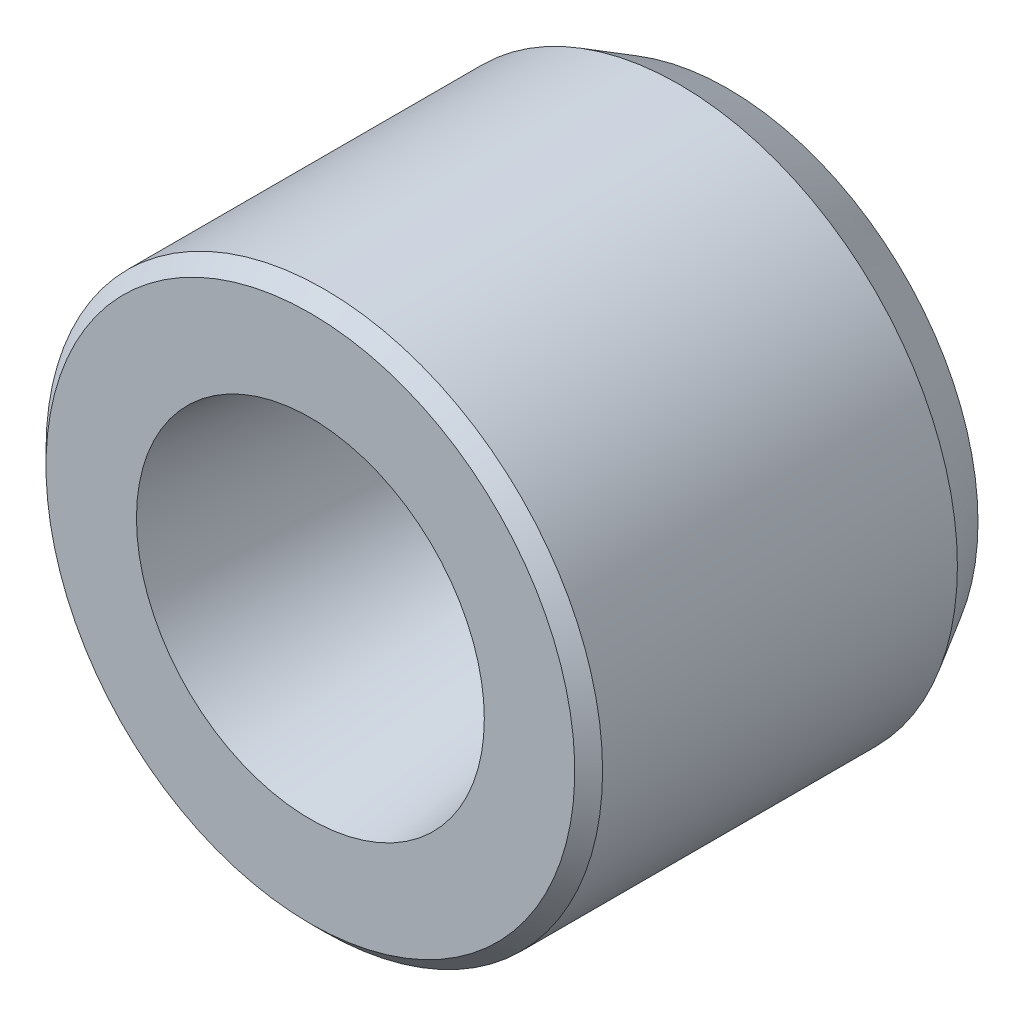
ISO-10303-21;
HEADER;
FILE_DESCRIPTION(('STEP AP214'),'2;1');
FILE_NAME('part.step','',(''),(''),'','','');
FILE_SCHEMA(('AUTOMOTIVE_DESIGN { 1 0 10303 214 1 1 1 1 }'));
ENDSEC;
DATA;
#1=APPLICATION_CONTEXT('core data for automotive mechanical design processes');
#2=APPLICATION_PROTOCOL_DEFINITION('international standard','automotive_design',2000,#1);
#3=PRODUCT_CONTEXT('',#1,'mechanical');
#4=PRODUCT('Part','Part','',(#3));
#5=PRODUCT_RELATED_PRODUCT_CATEGORY('part','',(#4));
#6=PRODUCT_DEFINITION_FORMATION('','',#4);
#7=PRODUCT_DEFINITION_CONTEXT('part definition',#1,'design');
#8=PRODUCT_DEFINITION('design','',#6,#7);
#9=PRODUCT_DEFINITION_SHAPE('','',#8);
#10=(LENGTH_UNIT() NAMED_UNIT(*) SI_UNIT(.MILLI.,.METRE.));
#11=(NAMED_UNIT(*) PLANE_ANGLE_UNIT() SI_UNIT($,.RADIAN.));
#12=(NAMED_UNIT(*) SI_UNIT($,.STERADIAN.) SOLID_ANGLE_UNIT());
#13=UNCERTAINTY_MEASURE_WITH_UNIT(LENGTH_MEASURE(1.E-05),#10,'distance_accuracy_value','');
#14=(GEOMETRIC_REPRESENTATION_CONTEXT(3) GLOBAL_UNCERTAINTY_ASSIGNED_CONTEXT((#13)) GLOBAL_UNIT_ASSIGNED_CONTEXT((#10,
#11,#12)) REPRESENTATION_CONTEXT('',''));
#15=CARTESIAN_POINT('',(0.,0.,0.));
#16=DIRECTION('',(0.,0.,1.));
#17=DIRECTION('',(1.,0.,0.));
#18=AXIS2_PLACEMENT_3D('',#15,#16,#17);
#19=CARTESIAN_POINT('',(0.,0.,-8.50378795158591E-11));
#20=DIRECTION('',(0.,0.,1.));
#21=DIRECTION('',(-1.,0.,0.));
#22=AXIS2_PLACEMENT_3D('',#19,#20,#21);
#23=CONICAL_SURFACE('',#22,2.49999999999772,0.130899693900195);
#24=CARTESIAN_POINT('',(0.,0.,2.86489582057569E-11));
#25=DIRECTION('',(0.,0.,1.));
#26=DIRECTION('',(-1.,0.,0.));
#27=AXIS2_PLACEMENT_3D('',#24,#25,#26);
#28=CIRCLE('',#27,2.5000000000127);
#29=CARTESIAN_POINT('',(-2.5000000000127,0.,2.86489582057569E-11));
#30=VERTEX_POINT('',#29);
#31=EDGE_CURVE('E15',#30,#30,#28,.F.);
#32=ORIENTED_EDGE('',*,*,#31,.F.);
#33=EDGE_LOOP('',(#32));
#34=FACE_BOUND('',#33,.T.);
#35=CARTESIAN_POINT('',(0.,0.,-6.));
#36=DIRECTION('',(0.,0.,1.));
#37=DIRECTION('',(-1.,0.,0.));
#38=AXIS2_PLACEMENT_3D('',#35,#36,#37);
#39=CIRCLE('',#38,1.71008501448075);
#40=CARTESIAN_POINT('',(-1.71008501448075,0.,-6.));
#41=VERTEX_POINT('',#40);
#42=EDGE_CURVE('E35',#41,#41,#39,.T.);
#43=ORIENTED_EDGE('',*,*,#42,.F.);
#44=EDGE_LOOP('',(#43));
#45=FACE_BOUND('',#44,.T.);
#46=ADVANCED_FACE('F12',(#34,#45),#23,.F.);
#47=CARTESIAN_POINT('',(3.8,0.,0.));
#48=DIRECTION('',(0.,0.,1.));
#49=DIRECTION('',(0.,-1.,0.));
#50=AXIS2_PLACEMENT_3D('',#47,#48,#49);
#51=PLANE('',#50);
#52=CARTESIAN_POINT('',(0.,0.,2.86489582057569E-11));
#53=DIRECTION('',(0.,0.,-1.));
#54=DIRECTION('',(0.,1.,0.));
#55=AXIS2_PLACEMENT_3D('',#52,#53,#54);
#56=CIRCLE('',#55,3.80000000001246);
#57=CARTESIAN_POINT('',(0.,3.80000000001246,2.86489582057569E-11));
#58=VERTEX_POINT('',#57);
#59=EDGE_CURVE('E33',#58,#58,#56,.T.);
#60=ORIENTED_EDGE('',*,*,#59,.F.);
#61=EDGE_LOOP('',(#60));
#62=FACE_BOUND('',#61,.T.);
#63=ORIENTED_EDGE('',*,*,#31,.T.);
#64=EDGE_LOOP('',(#63));
#65=FACE_BOUND('',#64,.T.);
#66=ADVANCED_FACE('F42',(#62,#65),#51,.T.);
#67=CARTESIAN_POINT('',(1.71008501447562,0.,-6.));
#68=DIRECTION('',(0.,0.,-1.));
#69=DIRECTION('',(0.,1.,0.));
#70=AXIS2_PLACEMENT_3D('',#67,#68,#69);
#71=PLANE('',#70);
#72=ORIENTED_EDGE('',*,*,#42,.T.);
#73=EDGE_LOOP('',(#72));
#74=FACE_BOUND('',#73,.T.);
#75=CARTESIAN_POINT('',(0.,0.,-6.));
#76=DIRECTION('',(0.,0.,1.));
#77=DIRECTION('',(0.,-1.,0.));
#78=AXIS2_PLACEMENT_3D('',#75,#76,#77);
#79=CIRCLE('',#78,3.59585481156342);
#80=CARTESIAN_POINT('',(0.,-3.59585481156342,-6.));
#81=VERTEX_POINT('',#80);
#82=EDGE_CURVE('E24',#81,#81,#79,.T.);
#83=ORIENTED_EDGE('',*,*,#82,.F.);
#84=EDGE_LOOP('',(#83));
#85=FACE_BOUND('',#84,.T.);
#86=ADVANCED_FACE('F50',(#74,#85),#71,.T.);
#87=CARTESIAN_POINT('',(0.,0.,-0.199999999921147));
#88=DIRECTION('',(0.,0.,-1.));
#89=DIRECTION('',(0.,1.,0.));
#90=AXIS2_PLACEMENT_3D('',#87,#88,#89);
#91=CONICAL_SURFACE('',#90,4.0000000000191,0.785398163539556);
#92=CARTESIAN_POINT('',(0.,0.,-0.2));
#93=DIRECTION('',(0.,0.,1.));
#94=DIRECTION('',(0.,-1.,0.));
#95=AXIS2_PLACEMENT_3D('',#92,#93,#94);
#96=CIRCLE('',#95,4.);
#97=CARTESIAN_POINT('',(0.,-4.,-0.2));
#98=VERTEX_POINT('',#97);
#99=EDGE_CURVE('E19',#98,#98,#96,.F.);
#100=ORIENTED_EDGE('',*,*,#99,.F.);
#101=EDGE_LOOP('',(#100));
#102=FACE_BOUND('',#101,.T.);
#103=ORIENTED_EDGE('',*,*,#59,.T.);
#104=EDGE_LOOP('',(#103));
#105=FACE_BOUND('',#104,.T.);
#106=ADVANCED_FACE('F59',(#102,#105),#91,.T.);
#107=CARTESIAN_POINT('',(0.,0.,-5.30000000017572));
#108=DIRECTION('',(0.,0.,1.));
#109=DIRECTION('',(0.,-1.,0.));
#110=AXIS2_PLACEMENT_3D('',#107,#108,#109);
#111=CONICAL_SURFACE('',#110,3.99999999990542,0.523598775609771);
#112=ORIENTED_EDGE('',*,*,#82,.T.);
#113=EDGE_LOOP('',(#112));
#114=FACE_BOUND('',#113,.T.);
#115=CARTESIAN_POINT('',(0.,0.,-5.3));
#116=DIRECTION('',(0.,0.,1.));
#117=DIRECTION('',(0.,-1.,0.));
#118=AXIS2_PLACEMENT_3D('',#115,#116,#117);
#119=CIRCLE('',#118,4.);
#120=CARTESIAN_POINT('',(0.,-4.,-5.3));
#121=VERTEX_POINT('',#120);
#122=EDGE_CURVE('E8',#121,#121,#119,.T.);
#123=ORIENTED_EDGE('',*,*,#122,.F.);
#124=EDGE_LOOP('',(#123));
#125=FACE_BOUND('',#124,.T.);
#126=ADVANCED_FACE('F54',(#114,#125),#111,.T.);
#127=CARTESIAN_POINT('',(0.,0.,-6.));
#128=DIRECTION('',(0.,0.,1.));
#129=DIRECTION('',(0.,-1.,0.));
#130=AXIS2_PLACEMENT_3D('',#127,#128,#129);
#131=CYLINDRICAL_SURFACE('',#130,4.);
#132=ORIENTED_EDGE('',*,*,#122,.T.);
#133=EDGE_LOOP('',(#132));
#134=FACE_BOUND('',#133,.T.);
#135=ORIENTED_EDGE('',*,*,#99,.T.);
#136=EDGE_LOOP('',(#135));
#137=FACE_BOUND('',#136,.T.);
#138=ADVANCED_FACE('F52',(#134,#137),#131,.T.);
#139=CLOSED_SHELL('',(#46,#66,#86,#106,#126,#138));
#140=MANIFOLD_SOLID_BREP('B1',#139);
#141=ADVANCED_BREP_SHAPE_REPRESENTATION('',(#18,#140),#14);
#142=SHAPE_DEFINITION_REPRESENTATION(#9,#141);
ENDSEC;
END-ISO-10303-21;
